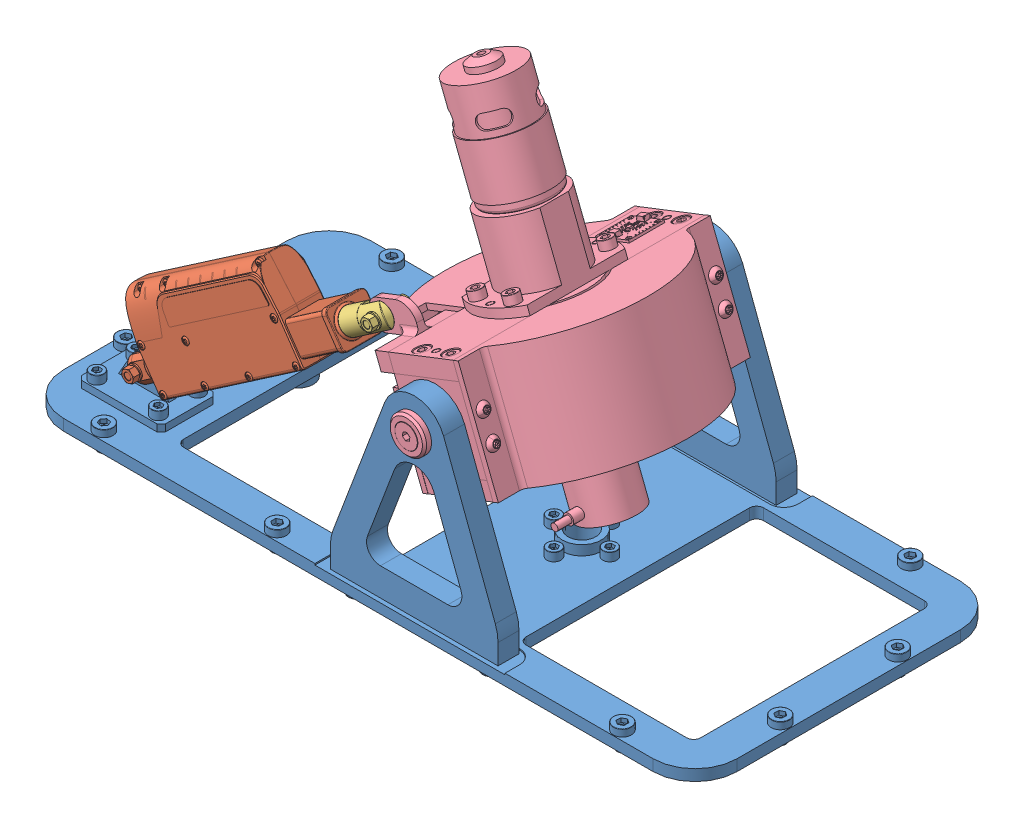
SolidWorks assembly Orientation_Cadre.SLDASM, configuration Défaut (file format 12000). Lengths in mm.
Overall size (482 303.54 222.75).
4 component instances, 4 part files, 6 mates.
Components (placement in the parent):
- structure-1: structure.SLDPRT [Défaut] at (-75.8614 -127.248 482) size (482 166.2 220)
- corps_verin-1: corps_verin.SLDPRT [Défaut] at (-215.9564 -50.2972 546.85) x (0.566101 -0.824336 0) z (-0.824336 -0.566101 0) size (61.61 33.46 185.99)
- tige_verin-1: tige_verin.SLDPRT [Défaut] at (-207.8087 -61.2607 546.9) x (0 0 -1) z (-0.824336 -0.566101 0) size (29.4 20.4 138.61)
- cadre-1: cadre.SLDPRT [Défaut] at (-93.1871 -120.3413 481.8) x (0.988626 -0.150394 0) z (0 0 1) size (188.27 236.73 220.75)
Mates (geometry in assembly coordinates):
- Coaxiale1: concentric aligned: cylinder of structure-1 through (-271.8614 -105.248 544.5) axis (0 0 1) radius 4; cylinder of corps_verin-1 through (-271.8614 -105.248 553.379) axis (0 0 1) radius 4
- Coïncidente1: coincident anti-aligned: plane of structure-1 through (-271.8614 -105.248 549.5) normal (0 0 1); plane of corps_verin-1 through (-256.9102 -105.2918 549.5) normal (0 0 -1)
- Coaxiale2: concentric aligned: cylinder of corps_verin-1 through (-137.089 -12.6949 546.9) axis (0.824336 0.566101 0) radius 8.5; cylinder of tige_verin-1 through (-199.5653 -55.5997 546.9) axis (0.824336 0.566101 0) radius 8.5
- Coaxiale3: concentric anti-aligned: cone of structure-1 through (-38.8614 -9.248 586.06) axis (0 0 1); cylinder of cadre-1 through (-38.8614 -9.248 553.2261) axis (0 0 -1) radius 8
- Coaxiale4: concentric aligned: cylinder of tige_verin-1 through (-100.8923 12.1626 553.379) axis (0 0 1) radius 4; cylinder of cadre-1 through (-100.8923 12.1626 544.3) axis (0 0 1) radius 4
- Coïncidente4: coincident anti-aligned: plane of tige_verin-1 through (-100.8923 12.1626 544.3) normal (0 0 1); plane of cadre-1 through (-101.2785 10.4016 544.3) normal (0 0 -1)
